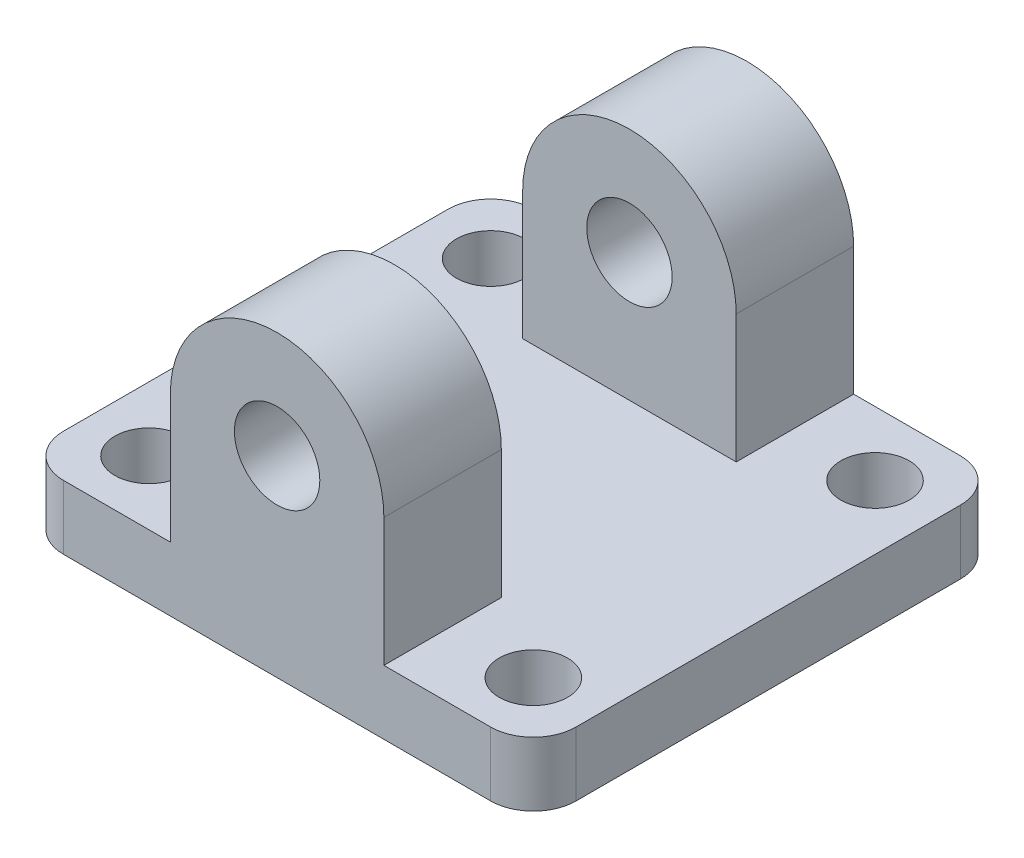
from build123d import *

# Parameters (mm, degrees)
EXTRUDE_1_DEPTH         = 22
SKETCH_2_W              = 11
SKETCH_2_H              = 11
CUT_EXTRUDE_2_DEPTH     = 8
HOLE_WIZARD_4_0_4_2_D   = 4
HOLE_WIZARD_3_2_3_2_1_D = 3.2
FILLET_1_R              = 2


with BuildPart() as part:
    # Sketch 1 → Extrude 1 (new body)
    with BuildSketch(Plane.XY):
        with BuildLine():
            Line((-12, 0), (12, 0))
            Line((12, 0), (12, 3))
            Line((12, 3), (5, 3))
            Line((5, 3), (5, 9))
            ThreePointArc((5, 9), (0, 14), (-5, 9))
            Line((-5, 9), (-5, 3))
            Line((-5, 3), (-12, 3))
            Line((-12, 3), (-12, 0))
        make_face()
    extrude(amount=EXTRUDE_1_DEPTH)

    # Sketch 2 → Cut-Extrude 2 (cut, symmetric)
    with BuildSketch(Plane(origin=(0, 0, 0), x_dir=(0, 0, -1), z_dir=(1, 0, 0))):
        with Locations((-11, 8.5)):
            Rectangle(SKETCH_2_W, SKETCH_2_H)
    extrude(amount=CUT_EXTRUDE_2_DEPTH, both=True, mode=Mode.SUBTRACT)

    # Hole Wizard 4.0 _4_ _2 (through all)
    with Locations(Plane.XY.offset(22)):
        with Locations((0, 9)):
            Hole(HOLE_WIZARD_4_0_4_2_D / 2)

    # Hole Wizard 3.2 _3.2_ _1 (through all)
    with Locations(Plane(origin=(0, 3, 0), x_dir=(1, 0, 0), z_dir=(0, 1, 0))):
        with Locations((9, -19), (-9, -3), (-9, -19), (9, -3)):
            Hole(HOLE_WIZARD_3_2_3_2_1_D / 2)

    # Fillet 1
    fillet_1_edges = [part.edges().sort_by_distance(p)[0] for p in [
        (12, 1.5, 22),
        (-12, 1.5, 0),
        (-12, 1.5, 22),
        (12, 1.5, 0),
    ]]
    fillet(fillet_1_edges, radius=FILLET_1_R)


solid = part.part
